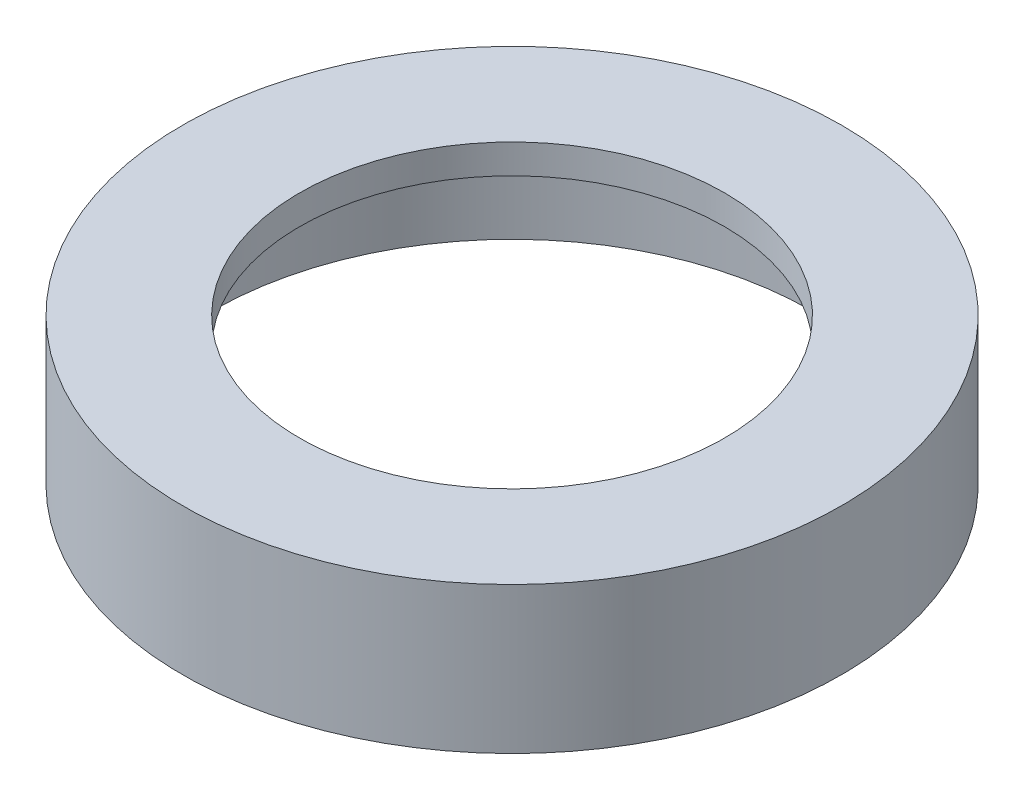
ISO-10303-21;
HEADER;
FILE_DESCRIPTION(('STEP AP214'),'2;1');
FILE_NAME('part.step','',(''),(''),'','','');
FILE_SCHEMA(('AUTOMOTIVE_DESIGN { 1 0 10303 214 1 1 1 1 }'));
ENDSEC;
DATA;
#1=APPLICATION_CONTEXT('core data for automotive mechanical design processes');
#2=APPLICATION_PROTOCOL_DEFINITION('international standard','automotive_design',2000,#1);
#3=PRODUCT_CONTEXT('',#1,'mechanical');
#4=PRODUCT('Part','Part','',(#3));
#5=PRODUCT_RELATED_PRODUCT_CATEGORY('part','',(#4));
#6=PRODUCT_DEFINITION_FORMATION('','',#4);
#7=PRODUCT_DEFINITION_CONTEXT('part definition',#1,'design');
#8=PRODUCT_DEFINITION('design','',#6,#7);
#9=PRODUCT_DEFINITION_SHAPE('','',#8);
#10=(LENGTH_UNIT() NAMED_UNIT(*) SI_UNIT(.MILLI.,.METRE.));
#11=(NAMED_UNIT(*) PLANE_ANGLE_UNIT() SI_UNIT($,.RADIAN.));
#12=(NAMED_UNIT(*) SI_UNIT($,.STERADIAN.) SOLID_ANGLE_UNIT());
#13=UNCERTAINTY_MEASURE_WITH_UNIT(LENGTH_MEASURE(1.E-05),#10,'distance_accuracy_value','');
#14=(GEOMETRIC_REPRESENTATION_CONTEXT(3) GLOBAL_UNCERTAINTY_ASSIGNED_CONTEXT((#13)) GLOBAL_UNIT_ASSIGNED_CONTEXT((#10,
#11,#12)) REPRESENTATION_CONTEXT('',''));
#15=CARTESIAN_POINT('',(0.,0.,0.));
#16=DIRECTION('',(0.,0.,1.));
#17=DIRECTION('',(1.,0.,0.));
#18=AXIS2_PLACEMENT_3D('',#15,#16,#17);
#19=CARTESIAN_POINT('',(-23.0378,136.525,0.));
#20=DIRECTION('',(0.,-1.,0.));
#21=DIRECTION('',(0.,0.,-1.));
#22=AXIS2_PLACEMENT_3D('',#19,#20,#21);
#23=PLANE('',#22);
#24=CARTESIAN_POINT('',(0.,136.525,0.));
#25=DIRECTION('',(0.,-1.,0.));
#26=DIRECTION('',(0.,0.,-1.));
#27=AXIS2_PLACEMENT_3D('',#24,#25,#26);
#28=CIRCLE('',#27,35.7378);
#29=CARTESIAN_POINT('',(0.,136.525,-35.7378));
#30=VERTEX_POINT('',#29);
#31=EDGE_CURVE('E10',#30,#30,#28,.T.);
#32=ORIENTED_EDGE('',*,*,#31,.F.);
#33=EDGE_LOOP('',(#32));
#34=FACE_BOUND('',#33,.T.);
#35=CARTESIAN_POINT('',(0.,136.525,0.));
#36=DIRECTION('',(0.,-1.,0.));
#37=DIRECTION('',(0.,0.,-1.));
#38=AXIS2_PLACEMENT_3D('',#35,#36,#37);
#39=CIRCLE('',#38,23.0378);
#40=CARTESIAN_POINT('',(0.,136.525,-23.0378));
#41=VERTEX_POINT('',#40);
#42=EDGE_CURVE('E55',#41,#41,#39,.T.);
#43=ORIENTED_EDGE('',*,*,#42,.T.);
#44=EDGE_LOOP('',(#43));
#45=FACE_BOUND('',#44,.T.);
#46=ADVANCED_FACE('F33',(#34,#45),#23,.F.);
#47=CARTESIAN_POINT('',(0.,0.,0.));
#48=DIRECTION('',(0.,-1.,0.));
#49=DIRECTION('',(0.,0.,-1.));
#50=AXIS2_PLACEMENT_3D('',#47,#48,#49);
#51=CYLINDRICAL_SURFACE('',#50,35.7378);
#52=CARTESIAN_POINT('',(0.,120.65,0.));
#53=DIRECTION('',(0.,-1.,0.));
#54=DIRECTION('',(0.,0.,-1.));
#55=AXIS2_PLACEMENT_3D('',#52,#53,#54);
#56=CIRCLE('',#55,35.7378);
#57=CARTESIAN_POINT('',(0.,120.65,-35.7378));
#58=VERTEX_POINT('',#57);
#59=EDGE_CURVE('E39',#58,#58,#56,.T.);
#60=ORIENTED_EDGE('',*,*,#59,.F.);
#61=EDGE_LOOP('',(#60));
#62=FACE_BOUND('',#61,.T.);
#63=ORIENTED_EDGE('',*,*,#31,.T.);
#64=EDGE_LOOP('',(#63));
#65=FACE_BOUND('',#64,.T.);
#66=ADVANCED_FACE('F80',(#62,#65),#51,.T.);
#67=CARTESIAN_POINT('',(-35.7378,120.65,0.));
#68=DIRECTION('',(0.,1.,0.));
#69=DIRECTION('',(0.,0.,1.));
#70=AXIS2_PLACEMENT_3D('',#67,#68,#69);
#71=PLANE('',#70);
#72=CARTESIAN_POINT('',(0.,120.65,0.));
#73=DIRECTION('',(0.,-1.,0.));
#74=DIRECTION('',(0.,0.,-1.));
#75=AXIS2_PLACEMENT_3D('',#72,#73,#74);
#76=CIRCLE('',#75,32.5628);
#77=CARTESIAN_POINT('',(0.,120.65,-32.5628));
#78=VERTEX_POINT('',#77);
#79=EDGE_CURVE('E43',#78,#78,#76,.T.);
#80=ORIENTED_EDGE('',*,*,#79,.F.);
#81=EDGE_LOOP('',(#80));
#82=FACE_BOUND('',#81,.T.);
#83=ORIENTED_EDGE('',*,*,#59,.T.);
#84=EDGE_LOOP('',(#83));
#85=FACE_BOUND('',#84,.T.);
#86=ADVANCED_FACE('F75',(#82,#85),#71,.F.);
#87=CARTESIAN_POINT('',(0.,0.,0.));
#88=DIRECTION('',(0.,-1.,0.));
#89=DIRECTION('',(0.,0.,-1.));
#90=AXIS2_PLACEMENT_3D('',#87,#88,#89);
#91=CYLINDRICAL_SURFACE('',#90,32.5628);
#92=CARTESIAN_POINT('',(0.,133.35,0.));
#93=DIRECTION('',(0.,-1.,0.));
#94=DIRECTION('',(0.,0.,-1.));
#95=AXIS2_PLACEMENT_3D('',#92,#93,#94);
#96=CIRCLE('',#95,32.5628);
#97=CARTESIAN_POINT('',(0.,133.35,-32.5628));
#98=VERTEX_POINT('',#97);
#99=EDGE_CURVE('E47',#98,#98,#96,.T.);
#100=ORIENTED_EDGE('',*,*,#99,.F.);
#101=EDGE_LOOP('',(#100));
#102=FACE_BOUND('',#101,.T.);
#103=ORIENTED_EDGE('',*,*,#79,.T.);
#104=EDGE_LOOP('',(#103));
#105=FACE_BOUND('',#104,.T.);
#106=ADVANCED_FACE('F69',(#102,#105),#91,.F.);
#107=CARTESIAN_POINT('',(-32.5628,133.35,0.));
#108=DIRECTION('',(0.,1.,0.));
#109=DIRECTION('',(0.,0.,1.));
#110=AXIS2_PLACEMENT_3D('',#107,#108,#109);
#111=PLANE('',#110);
#112=CARTESIAN_POINT('',(0.,133.35,0.));
#113=DIRECTION('',(0.,-1.,0.));
#114=DIRECTION('',(0.,0.,-1.));
#115=AXIS2_PLACEMENT_3D('',#112,#113,#114);
#116=CIRCLE('',#115,23.0378);
#117=CARTESIAN_POINT('',(0.,133.35,-23.0378));
#118=VERTEX_POINT('',#117);
#119=EDGE_CURVE('E52',#118,#118,#116,.T.);
#120=ORIENTED_EDGE('',*,*,#119,.F.);
#121=EDGE_LOOP('',(#120));
#122=FACE_BOUND('',#121,.T.);
#123=ORIENTED_EDGE('',*,*,#99,.T.);
#124=EDGE_LOOP('',(#123));
#125=FACE_BOUND('',#124,.T.);
#126=ADVANCED_FACE('F63',(#122,#125),#111,.F.);
#127=CARTESIAN_POINT('',(0.,0.,0.));
#128=DIRECTION('',(0.,-1.,0.));
#129=DIRECTION('',(0.,0.,-1.));
#130=AXIS2_PLACEMENT_3D('',#127,#128,#129);
#131=CYLINDRICAL_SURFACE('',#130,23.0378);
#132=ORIENTED_EDGE('',*,*,#42,.F.);
#133=EDGE_LOOP('',(#132));
#134=FACE_BOUND('',#133,.T.);
#135=ORIENTED_EDGE('',*,*,#119,.T.);
#136=EDGE_LOOP('',(#135));
#137=FACE_BOUND('',#136,.T.);
#138=ADVANCED_FACE('F60',(#134,#137),#131,.F.);
#139=CLOSED_SHELL('',(#46,#66,#86,#106,#126,#138));
#140=MANIFOLD_SOLID_BREP('B2',#139);
#141=ADVANCED_BREP_SHAPE_REPRESENTATION('',(#18,#140),#14);
#142=SHAPE_DEFINITION_REPRESENTATION(#9,#141);
ENDSEC;
END-ISO-10303-21;
